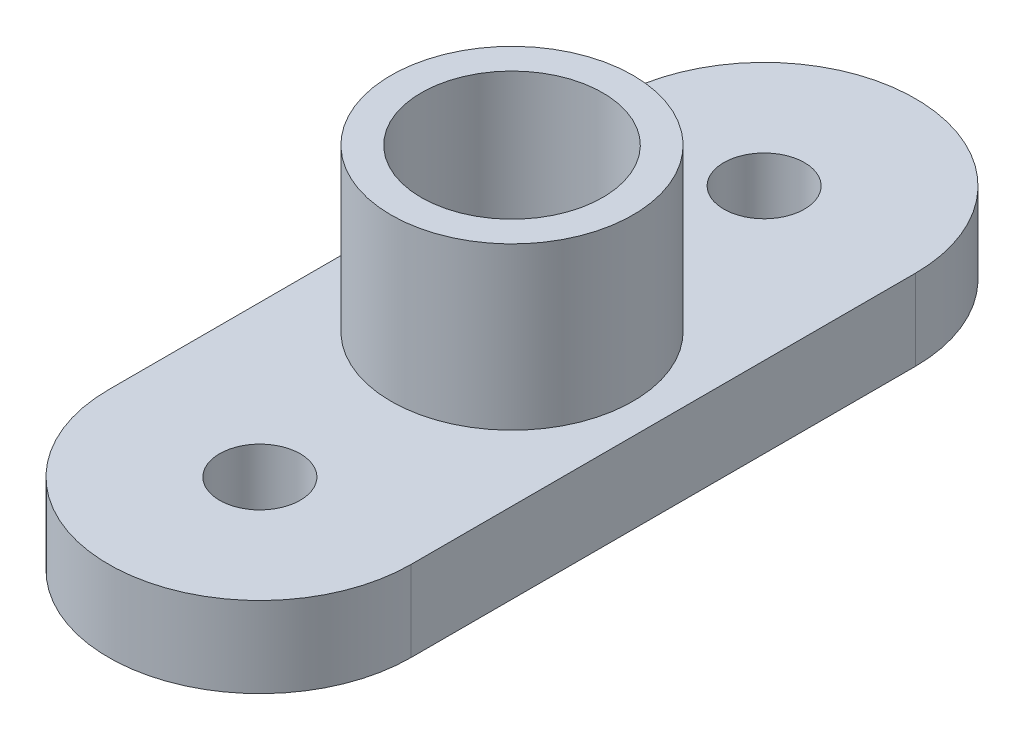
ISO-10303-21;
HEADER;
FILE_DESCRIPTION(('STEP AP214'),'2;1');
FILE_NAME('part.step','',(''),(''),'','','');
FILE_SCHEMA(('AUTOMOTIVE_DESIGN { 1 0 10303 214 1 1 1 1 }'));
ENDSEC;
DATA;
#1=APPLICATION_CONTEXT('core data for automotive mechanical design processes');
#2=APPLICATION_PROTOCOL_DEFINITION('international standard','automotive_design',2000,#1);
#3=PRODUCT_CONTEXT('',#1,'mechanical');
#4=PRODUCT('Part','Part','',(#3));
#5=PRODUCT_RELATED_PRODUCT_CATEGORY('part','',(#4));
#6=PRODUCT_DEFINITION_FORMATION('','',#4);
#7=PRODUCT_DEFINITION_CONTEXT('part definition',#1,'design');
#8=PRODUCT_DEFINITION('design','',#6,#7);
#9=PRODUCT_DEFINITION_SHAPE('','',#8);
#10=(LENGTH_UNIT() NAMED_UNIT(*) SI_UNIT(.MILLI.,.METRE.));
#11=(NAMED_UNIT(*) PLANE_ANGLE_UNIT() SI_UNIT($,.RADIAN.));
#12=(NAMED_UNIT(*) SI_UNIT($,.STERADIAN.) SOLID_ANGLE_UNIT());
#13=UNCERTAINTY_MEASURE_WITH_UNIT(LENGTH_MEASURE(1.E-05),#10,'distance_accuracy_value','');
#14=(GEOMETRIC_REPRESENTATION_CONTEXT(3) GLOBAL_UNCERTAINTY_ASSIGNED_CONTEXT((#13)) GLOBAL_UNIT_ASSIGNED_CONTEXT((#10,
#11,#12)) REPRESENTATION_CONTEXT('',''));
#15=CARTESIAN_POINT('',(0.,0.,0.));
#16=DIRECTION('',(0.,0.,1.));
#17=DIRECTION('',(1.,0.,0.));
#18=AXIS2_PLACEMENT_3D('',#15,#16,#17);
#19=CARTESIAN_POINT('',(0.,16.,0.));
#20=DIRECTION('',(0.,-1.,0.));
#21=DIRECTION('',(0.,0.,-1.));
#22=AXIS2_PLACEMENT_3D('',#19,#20,#21);
#23=CYLINDRICAL_SURFACE('',#22,12.);
#24=CARTESIAN_POINT('',(0.,16.,0.));
#25=DIRECTION('',(0.,1.,0.));
#26=DIRECTION('',(0.,0.,1.));
#27=AXIS2_PLACEMENT_3D('',#24,#25,#26);
#28=CIRCLE('',#27,12.);
#29=CARTESIAN_POINT('',(0.,16.,12.));
#30=VERTEX_POINT('',#29);
#31=EDGE_CURVE('E11',#30,#30,#28,.T.);
#32=ORIENTED_EDGE('',*,*,#31,.F.);
#33=EDGE_LOOP('',(#32));
#34=FACE_BOUND('',#33,.T.);
#35=CARTESIAN_POINT('',(0.,0.,0.));
#36=DIRECTION('',(0.,-1.,0.));
#37=DIRECTION('',(0.,0.,-1.));
#38=AXIS2_PLACEMENT_3D('',#35,#36,#37);
#39=CIRCLE('',#38,12.);
#40=CARTESIAN_POINT('',(0.,0.,-12.));
#41=VERTEX_POINT('',#40);
#42=EDGE_CURVE('E356',#41,#41,#39,.T.);
#43=ORIENTED_EDGE('',*,*,#42,.F.);
#44=EDGE_LOOP('',(#43));
#45=FACE_BOUND('',#44,.T.);
#46=ADVANCED_FACE('F349',(#34,#45),#23,.T.);
#47=CARTESIAN_POINT('',(0.,16.,0.));
#48=DIRECTION('',(0.,1.,0.));
#49=DIRECTION('',(0.,0.,1.));
#50=AXIS2_PLACEMENT_3D('',#47,#48,#49);
#51=PLANE('',#50);
#52=CARTESIAN_POINT('',(0.,16.,0.));
#53=DIRECTION('',(0.,1.,0.));
#54=DIRECTION('',(0.,0.,1.));
#55=AXIS2_PLACEMENT_3D('',#52,#53,#54);
#56=CIRCLE('',#55,9.);
#57=CARTESIAN_POINT('',(0.,16.,9.));
#58=VERTEX_POINT('',#57);
#59=EDGE_CURVE('E485',#58,#58,#56,.T.);
#60=ORIENTED_EDGE('',*,*,#59,.F.);
#61=EDGE_LOOP('',(#60));
#62=FACE_BOUND('',#61,.T.);
#63=ORIENTED_EDGE('',*,*,#31,.T.);
#64=EDGE_LOOP('',(#63));
#65=FACE_BOUND('',#64,.T.);
#66=ADVANCED_FACE('F436',(#62,#65),#51,.T.);
#67=CARTESIAN_POINT('',(0.,0.,25.));
#68=DIRECTION('',(0.,-1.,0.));
#69=DIRECTION('',(0.,0.,-1.));
#70=AXIS2_PLACEMENT_3D('',#67,#68,#69);
#71=PLANE('',#70);
#72=CARTESIAN_POINT('',(0.,0.,25.));
#73=DIRECTION('',(0.,-1.,0.));
#74=DIRECTION('',(0.,0.,-1.));
#75=AXIS2_PLACEMENT_3D('',#72,#73,#74);
#76=CIRCLE('',#75,4.);
#77=CARTESIAN_POINT('',(0.,0.,21.));
#78=VERTEX_POINT('',#77);
#79=EDGE_CURVE('E487',#78,#78,#76,.T.);
#80=ORIENTED_EDGE('',*,*,#79,.T.);
#81=EDGE_LOOP('',(#80));
#82=FACE_BOUND('',#81,.T.);
#83=CARTESIAN_POINT('',(0.,0.,25.));
#84=DIRECTION('',(0.,-1.,0.));
#85=DIRECTION('',(0.,0.,-1.));
#86=AXIS2_PLACEMENT_3D('',#83,#84,#85);
#87=CIRCLE('',#86,15.);
#88=CARTESIAN_POINT('',(15.,0.,25.));
#89=VERTEX_POINT('',#88);
#90=CARTESIAN_POINT('',(-15.,0.,25.));
#91=VERTEX_POINT('',#90);
#92=EDGE_CURVE('E395',#89,#91,#87,.T.);
#93=ORIENTED_EDGE('',*,*,#92,.F.);
#94=DIRECTION('',(0.,0.,1.));
#95=VECTOR('',#94,1.);
#96=CARTESIAN_POINT('',(15.,0.,25.));
#97=LINE('',#96,#95);
#98=CARTESIAN_POINT('',(15.,0.,-25.));
#99=VERTEX_POINT('',#98);
#100=EDGE_CURVE('E420',#99,#89,#97,.T.);
#101=ORIENTED_EDGE('',*,*,#100,.F.);
#102=CARTESIAN_POINT('',(0.,0.,-25.));
#103=DIRECTION('',(0.,-1.,0.));
#104=DIRECTION('',(0.,0.,-1.));
#105=AXIS2_PLACEMENT_3D('',#102,#103,#104);
#106=CIRCLE('',#105,15.);
#107=CARTESIAN_POINT('',(-15.,0.,-25.));
#108=VERTEX_POINT('',#107);
#109=EDGE_CURVE('E396',#108,#99,#106,.T.);
#110=ORIENTED_EDGE('',*,*,#109,.F.);
#111=DIRECTION('',(0.,0.,-1.));
#112=VECTOR('',#111,1.);
#113=CARTESIAN_POINT('',(-15.,0.,-25.));
#114=LINE('',#113,#112);
#115=EDGE_CURVE('E389',#91,#108,#114,.T.);
#116=ORIENTED_EDGE('',*,*,#115,.F.);
#117=EDGE_LOOP('',(#93,#101,#110,#116));
#118=FACE_BOUND('',#117,.T.);
#119=CARTESIAN_POINT('',(0.,0.,-25.));
#120=DIRECTION('',(0.,-1.,0.));
#121=DIRECTION('',(0.,0.,-1.));
#122=AXIS2_PLACEMENT_3D('',#119,#120,#121);
#123=CIRCLE('',#122,4.);
#124=CARTESIAN_POINT('',(0.,0.,-29.));
#125=VERTEX_POINT('',#124);
#126=EDGE_CURVE('E415',#125,#125,#123,.T.);
#127=ORIENTED_EDGE('',*,*,#126,.T.);
#128=EDGE_LOOP('',(#127));
#129=FACE_BOUND('',#128,.T.);
#130=ORIENTED_EDGE('',*,*,#42,.T.);
#131=EDGE_LOOP('',(#130));
#132=FACE_BOUND('',#131,.T.);
#133=ADVANCED_FACE('F391',(#82,#118,#129,#132),#71,.F.);
#134=CARTESIAN_POINT('',(0.,-8.,25.));
#135=DIRECTION('',(0.,-1.,0.));
#136=DIRECTION('',(0.,0.,-1.));
#137=AXIS2_PLACEMENT_3D('',#134,#135,#136);
#138=PLANE('',#137);
#139=CARTESIAN_POINT('',(0.,-8.,0.));
#140=DIRECTION('',(0.,1.,0.));
#141=DIRECTION('',(0.,0.,1.));
#142=AXIS2_PLACEMENT_3D('',#139,#140,#141);
#143=CIRCLE('',#142,9.);
#144=CARTESIAN_POINT('',(0.,-8.,9.));
#145=VERTEX_POINT('',#144);
#146=EDGE_CURVE('E483',#145,#145,#143,.T.);
#147=ORIENTED_EDGE('',*,*,#146,.T.);
#148=EDGE_LOOP('',(#147));
#149=FACE_BOUND('',#148,.T.);
#150=CARTESIAN_POINT('',(0.,-8.,-25.));
#151=DIRECTION('',(0.,-1.,0.));
#152=DIRECTION('',(0.,0.,-1.));
#153=AXIS2_PLACEMENT_3D('',#150,#151,#152);
#154=CIRCLE('',#153,4.);
#155=CARTESIAN_POINT('',(0.,-8.,-29.));
#156=VERTEX_POINT('',#155);
#157=EDGE_CURVE('E412',#156,#156,#154,.T.);
#158=ORIENTED_EDGE('',*,*,#157,.F.);
#159=EDGE_LOOP('',(#158));
#160=FACE_BOUND('',#159,.T.);
#161=CARTESIAN_POINT('',(0.,-8.,25.));
#162=DIRECTION('',(0.,-1.,0.));
#163=DIRECTION('',(0.,0.,-1.));
#164=AXIS2_PLACEMENT_3D('',#161,#162,#163);
#165=CIRCLE('',#164,15.);
#166=CARTESIAN_POINT('',(15.,-8.,25.));
#167=VERTEX_POINT('',#166);
#168=CARTESIAN_POINT('',(-15.,-8.,25.));
#169=VERTEX_POINT('',#168);
#170=EDGE_CURVE('E422',#167,#169,#165,.T.);
#171=ORIENTED_EDGE('',*,*,#170,.T.);
#172=DIRECTION('',(0.,0.,-1.));
#173=VECTOR('',#172,1.);
#174=CARTESIAN_POINT('',(-15.,-8.,-25.));
#175=LINE('',#174,#173);
#176=CARTESIAN_POINT('',(-15.,-8.,-25.));
#177=VERTEX_POINT('',#176);
#178=EDGE_CURVE('E404',#169,#177,#175,.T.);
#179=ORIENTED_EDGE('',*,*,#178,.T.);
#180=CARTESIAN_POINT('',(0.,-8.,-25.));
#181=DIRECTION('',(0.,-1.,0.));
#182=DIRECTION('',(0.,0.,-1.));
#183=AXIS2_PLACEMENT_3D('',#180,#181,#182);
#184=CIRCLE('',#183,15.);
#185=CARTESIAN_POINT('',(15.,-8.,-25.));
#186=VERTEX_POINT('',#185);
#187=EDGE_CURVE('E368',#177,#186,#184,.T.);
#188=ORIENTED_EDGE('',*,*,#187,.T.);
#189=DIRECTION('',(0.,0.,1.));
#190=VECTOR('',#189,1.);
#191=CARTESIAN_POINT('',(15.,-8.,25.));
#192=LINE('',#191,#190);
#193=EDGE_CURVE('E363',#186,#167,#192,.T.);
#194=ORIENTED_EDGE('',*,*,#193,.T.);
#195=EDGE_LOOP('',(#171,#179,#188,#194));
#196=FACE_BOUND('',#195,.T.);
#197=CARTESIAN_POINT('',(0.,-8.,25.));
#198=DIRECTION('',(0.,-1.,0.));
#199=DIRECTION('',(0.,0.,-1.));
#200=AXIS2_PLACEMENT_3D('',#197,#198,#199);
#201=CIRCLE('',#200,4.);
#202=CARTESIAN_POINT('',(0.,-8.,21.));
#203=VERTEX_POINT('',#202);
#204=EDGE_CURVE('E492',#203,#203,#201,.T.);
#205=ORIENTED_EDGE('',*,*,#204,.F.);
#206=EDGE_LOOP('',(#205));
#207=FACE_BOUND('',#206,.T.);
#208=ADVANCED_FACE('F449',(#149,#160,#196,#207),#138,.T.);
#209=CARTESIAN_POINT('',(0.,-8.,25.));
#210=DIRECTION('',(0.,1.,0.));
#211=DIRECTION('',(0.,0.,1.));
#212=AXIS2_PLACEMENT_3D('',#209,#210,#211);
#213=CYLINDRICAL_SURFACE('',#212,15.);
#214=ORIENTED_EDGE('',*,*,#92,.T.);
#215=DIRECTION('',(0.,1.,0.));
#216=VECTOR('',#215,1.);
#217=CARTESIAN_POINT('',(-15.,-8.,25.));
#218=LINE('',#217,#216);
#219=EDGE_CURVE('E402',#169,#91,#218,.T.);
#220=ORIENTED_EDGE('',*,*,#219,.F.);
#221=ORIENTED_EDGE('',*,*,#170,.F.);
#222=DIRECTION('',(0.,1.,0.));
#223=VECTOR('',#222,1.);
#224=CARTESIAN_POINT('',(15.,-8.,25.));
#225=LINE('',#224,#223);
#226=EDGE_CURVE('E411',#167,#89,#225,.T.);
#227=ORIENTED_EDGE('',*,*,#226,.T.);
#228=EDGE_LOOP('',(#214,#220,#221,#227));
#229=FACE_BOUND('',#228,.T.);
#230=ADVANCED_FACE('F410',(#229),#213,.T.);
#231=CARTESIAN_POINT('',(-15.,-8.,-25.));
#232=DIRECTION('',(1.,0.,0.));
#233=DIRECTION('',(0.,0.,-1.));
#234=AXIS2_PLACEMENT_3D('',#231,#232,#233);
#235=PLANE('',#234);
#236=ORIENTED_EDGE('',*,*,#115,.T.);
#237=DIRECTION('',(0.,1.,0.));
#238=VECTOR('',#237,1.);
#239=CARTESIAN_POINT('',(-15.,-8.,-25.));
#240=LINE('',#239,#238);
#241=EDGE_CURVE('E407',#177,#108,#240,.T.);
#242=ORIENTED_EDGE('',*,*,#241,.F.);
#243=ORIENTED_EDGE('',*,*,#178,.F.);
#244=ORIENTED_EDGE('',*,*,#219,.T.);
#245=EDGE_LOOP('',(#236,#242,#243,#244));
#246=FACE_BOUND('',#245,.T.);
#247=ADVANCED_FACE('F403',(#246),#235,.F.);
#248=CARTESIAN_POINT('',(0.,-8.,-25.));
#249=DIRECTION('',(0.,1.,0.));
#250=DIRECTION('',(0.,0.,1.));
#251=AXIS2_PLACEMENT_3D('',#248,#249,#250);
#252=CYLINDRICAL_SURFACE('',#251,15.);
#253=ORIENTED_EDGE('',*,*,#109,.T.);
#254=DIRECTION('',(0.,1.,0.));
#255=VECTOR('',#254,1.);
#256=CARTESIAN_POINT('',(15.,-8.,-25.));
#257=LINE('',#256,#255);
#258=EDGE_CURVE('E428',#186,#99,#257,.T.);
#259=ORIENTED_EDGE('',*,*,#258,.F.);
#260=ORIENTED_EDGE('',*,*,#187,.F.);
#261=ORIENTED_EDGE('',*,*,#241,.T.);
#262=EDGE_LOOP('',(#253,#259,#260,#261));
#263=FACE_BOUND('',#262,.T.);
#264=ADVANCED_FACE('F458',(#263),#252,.T.);
#265=CARTESIAN_POINT('',(15.,-8.,25.));
#266=DIRECTION('',(-1.,0.,0.));
#267=DIRECTION('',(0.,0.,1.));
#268=AXIS2_PLACEMENT_3D('',#265,#266,#267);
#269=PLANE('',#268);
#270=ORIENTED_EDGE('',*,*,#100,.T.);
#271=ORIENTED_EDGE('',*,*,#226,.F.);
#272=ORIENTED_EDGE('',*,*,#193,.F.);
#273=ORIENTED_EDGE('',*,*,#258,.T.);
#274=EDGE_LOOP('',(#270,#271,#272,#273));
#275=FACE_BOUND('',#274,.T.);
#276=ADVANCED_FACE('F461',(#275),#269,.F.);
#277=CARTESIAN_POINT('',(0.,-8.,-25.));
#278=DIRECTION('',(0.,1.,0.));
#279=DIRECTION('',(0.,0.,1.));
#280=AXIS2_PLACEMENT_3D('',#277,#278,#279);
#281=CYLINDRICAL_SURFACE('',#280,4.);
#282=ORIENTED_EDGE('',*,*,#157,.T.);
#283=EDGE_LOOP('',(#282));
#284=FACE_BOUND('',#283,.T.);
#285=ORIENTED_EDGE('',*,*,#126,.F.);
#286=EDGE_LOOP('',(#285));
#287=FACE_BOUND('',#286,.T.);
#288=ADVANCED_FACE('F465',(#284,#287),#281,.F.);
#289=CARTESIAN_POINT('',(0.,-8.,25.));
#290=DIRECTION('',(0.,1.,0.));
#291=DIRECTION('',(0.,0.,1.));
#292=AXIS2_PLACEMENT_3D('',#289,#290,#291);
#293=CYLINDRICAL_SURFACE('',#292,4.);
#294=ORIENTED_EDGE('',*,*,#204,.T.);
#295=EDGE_LOOP('',(#294));
#296=FACE_BOUND('',#295,.T.);
#297=ORIENTED_EDGE('',*,*,#79,.F.);
#298=EDGE_LOOP('',(#297));
#299=FACE_BOUND('',#298,.T.);
#300=ADVANCED_FACE('F471',(#296,#299),#293,.F.);
#301=CARTESIAN_POINT('',(0.,-8.,0.));
#302=DIRECTION('',(0.,1.,0.));
#303=DIRECTION('',(0.,0.,1.));
#304=AXIS2_PLACEMENT_3D('',#301,#302,#303);
#305=CYLINDRICAL_SURFACE('',#304,9.);
#306=ORIENTED_EDGE('',*,*,#146,.F.);
#307=EDGE_LOOP('',(#306));
#308=FACE_BOUND('',#307,.T.);
#309=ORIENTED_EDGE('',*,*,#59,.T.);
#310=EDGE_LOOP('',(#309));
#311=FACE_BOUND('',#310,.T.);
#312=ADVANCED_FACE('F474',(#308,#311),#305,.F.);
#313=CLOSED_SHELL('',(#46,#66,#133,#208,#230,#247,#264,#276,#288,#300,#312));
#314=MANIFOLD_SOLID_BREP('B2',#313);
#315=ADVANCED_BREP_SHAPE_REPRESENTATION('',(#18,#314),#14);
#316=SHAPE_DEFINITION_REPRESENTATION(#9,#315);
ENDSEC;
END-ISO-10303-21;
